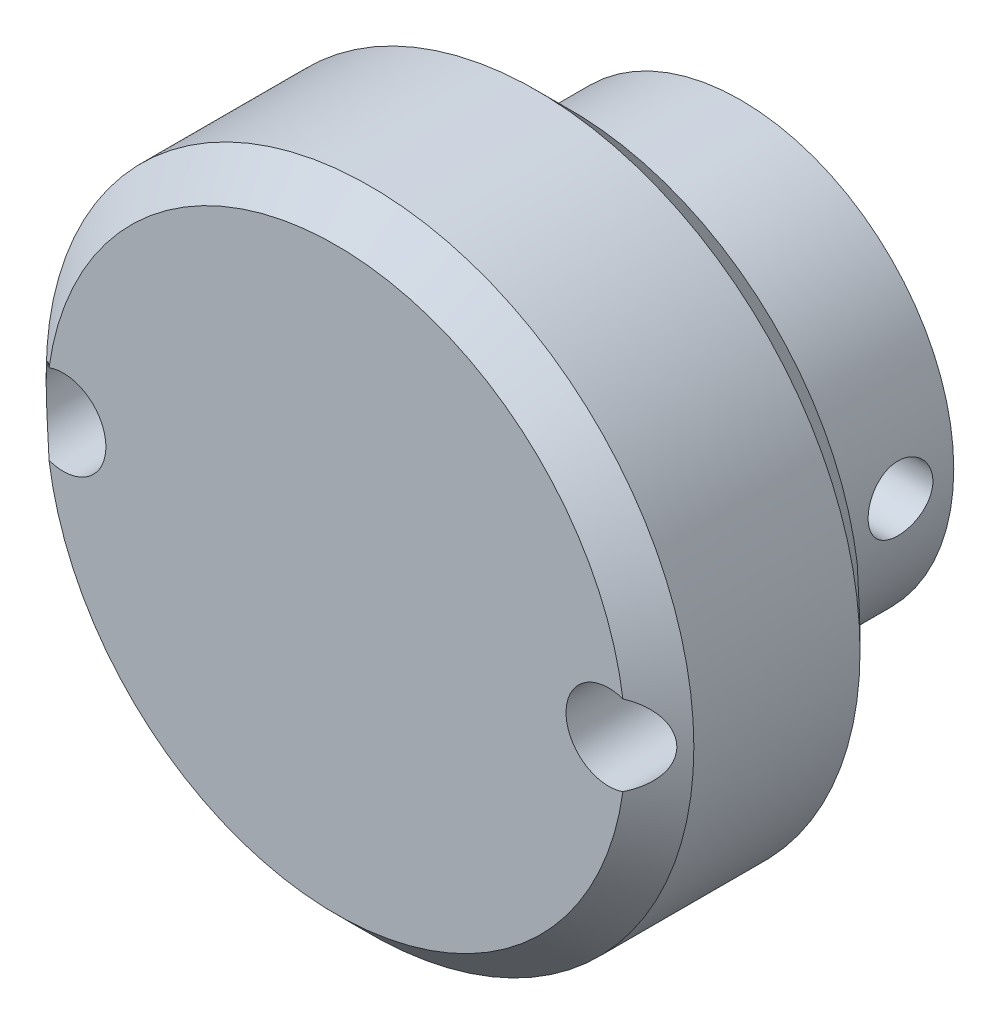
ISO-10303-21;
HEADER;
FILE_DESCRIPTION(('STEP AP214'),'2;1');
FILE_NAME('part.step','',(''),(''),'','','');
FILE_SCHEMA(('AUTOMOTIVE_DESIGN { 1 0 10303 214 1 1 1 1 }'));
ENDSEC;
DATA;
#1=APPLICATION_CONTEXT('core data for automotive mechanical design processes');
#2=APPLICATION_PROTOCOL_DEFINITION('international standard','automotive_design',2000,#1);
#3=PRODUCT_CONTEXT('',#1,'mechanical');
#4=PRODUCT('Part','Part','',(#3));
#5=PRODUCT_RELATED_PRODUCT_CATEGORY('part','',(#4));
#6=PRODUCT_DEFINITION_FORMATION('','',#4);
#7=PRODUCT_DEFINITION_CONTEXT('part definition',#1,'design');
#8=PRODUCT_DEFINITION('design','',#6,#7);
#9=PRODUCT_DEFINITION_SHAPE('','',#8);
#10=(LENGTH_UNIT() NAMED_UNIT(*) SI_UNIT(.MILLI.,.METRE.));
#11=(NAMED_UNIT(*) PLANE_ANGLE_UNIT() SI_UNIT($,.RADIAN.));
#12=(NAMED_UNIT(*) SI_UNIT($,.STERADIAN.) SOLID_ANGLE_UNIT());
#13=UNCERTAINTY_MEASURE_WITH_UNIT(LENGTH_MEASURE(1.E-05),#10,'distance_accuracy_value','');
#14=(GEOMETRIC_REPRESENTATION_CONTEXT(3) GLOBAL_UNCERTAINTY_ASSIGNED_CONTEXT((#13)) GLOBAL_UNIT_ASSIGNED_CONTEXT((#10,
#11,#12)) REPRESENTATION_CONTEXT('',''));
#15=CARTESIAN_POINT('',(0.,0.,0.));
#16=DIRECTION('',(0.,0.,1.));
#17=DIRECTION('',(1.,0.,0.));
#18=AXIS2_PLACEMENT_3D('',#15,#16,#17);
#19=CARTESIAN_POINT('',(0.,15.875,15.875));
#20=DIRECTION('',(0.,0.,-1.));
#21=DIRECTION('',(0.,1.,0.));
#22=AXIS2_PLACEMENT_3D('',#19,#20,#21);
#23=PLANE('',#22);
#24=CARTESIAN_POINT('',(0.,0.,15.875));
#25=DIRECTION('',(0.,0.,-1.));
#26=DIRECTION('',(0.,1.,0.));
#27=AXIS2_PLACEMENT_3D('',#24,#25,#26);
#28=CIRCLE('',#27,15.875);
#29=CARTESIAN_POINT('',(0.,15.875,15.875));
#30=VERTEX_POINT('',#29);
#31=EDGE_CURVE('E103',#30,#30,#28,.T.);
#32=ORIENTED_EDGE('',*,*,#31,.F.);
#33=EDGE_LOOP('',(#32));
#34=FACE_BOUND('',#33,.T.);
#35=CARTESIAN_POINT('',(-20.32,0.,15.875));
#36=DIRECTION('',(0.,0.,-1.));
#37=DIRECTION('',(0.,1.,0.));
#38=AXIS2_PLACEMENT_3D('',#35,#36,#37);
#39=CIRCLE('',#38,3.175);
#40=CARTESIAN_POINT('',(-21.381640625,2.9922473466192,15.875));
#41=VERTEX_POINT('',#40);
#42=CARTESIAN_POINT('',(-21.381640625,-2.9922473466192,15.875));
#43=VERTEX_POINT('',#42);
#44=EDGE_CURVE('E305',#41,#43,#39,.T.);
#45=ORIENTED_EDGE('',*,*,#44,.F.);
#46=CARTESIAN_POINT('',(0.,0.,15.875));
#47=DIRECTION('',(0.,0.,-1.));
#48=DIRECTION('',(0.,1.,0.));
#49=AXIS2_PLACEMENT_3D('',#46,#47,#48);
#50=CIRCLE('',#49,21.59);
#51=CARTESIAN_POINT('',(21.381640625,2.9922473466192,15.875));
#52=VERTEX_POINT('',#51);
#53=EDGE_CURVE('E143',#41,#52,#50,.T.);
#54=ORIENTED_EDGE('',*,*,#53,.T.);
#55=CARTESIAN_POINT('',(20.32,0.,15.875));
#56=DIRECTION('',(0.,0.,-1.));
#57=DIRECTION('',(0.,1.,0.));
#58=AXIS2_PLACEMENT_3D('',#55,#56,#57);
#59=CIRCLE('',#58,3.175);
#60=CARTESIAN_POINT('',(21.381640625,-2.9922473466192,15.875));
#61=VERTEX_POINT('',#60);
#62=EDGE_CURVE('E99',#61,#52,#59,.T.);
#63=ORIENTED_EDGE('',*,*,#62,.F.);
#64=CARTESIAN_POINT('',(0.,0.,15.875));
#65=DIRECTION('',(0.,0.,-1.));
#66=DIRECTION('',(0.,1.,0.));
#67=AXIS2_PLACEMENT_3D('',#64,#65,#66);
#68=CIRCLE('',#67,21.59);
#69=EDGE_CURVE('E61',#61,#43,#68,.T.);
#70=ORIENTED_EDGE('',*,*,#69,.T.);
#71=EDGE_LOOP('',(#45,#54,#63,#70));
#72=FACE_BOUND('',#71,.T.);
#73=ADVANCED_FACE('F40',(#34,#72),#23,.T.);
#74=CARTESIAN_POINT('',(0.,28.575,33.3375));
#75=DIRECTION('',(0.,0.,1.));
#76=DIRECTION('',(0.,-1.,0.));
#77=AXIS2_PLACEMENT_3D('',#74,#75,#76);
#78=PLANE('',#77);
#79=CARTESIAN_POINT('',(-20.32,0.,33.3375));
#80=DIRECTION('',(0.,0.,-1.));
#81=DIRECTION('',(0.,1.,0.));
#82=AXIS2_PLACEMENT_3D('',#79,#80,#81);
#83=CIRCLE('',#82,3.175);
#84=CARTESIAN_POINT('',(-21.381640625,2.9922473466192,33.3375));
#85=VERTEX_POINT('',#84);
#86=CARTESIAN_POINT('',(-21.381640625,-2.99224734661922,33.3375));
#87=VERTEX_POINT('',#86);
#88=EDGE_CURVE('E304',#85,#87,#83,.T.);
#89=ORIENTED_EDGE('',*,*,#88,.T.);
#90=CARTESIAN_POINT('',(0.,0.,33.3375));
#91=DIRECTION('',(0.,0.,1.));
#92=DIRECTION('',(0.,-1.,0.));
#93=AXIS2_PLACEMENT_3D('',#90,#91,#92);
#94=CIRCLE('',#93,21.59);
#95=CARTESIAN_POINT('',(21.381640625,-2.99224734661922,33.3375));
#96=VERTEX_POINT('',#95);
#97=EDGE_CURVE('E91',#87,#96,#94,.T.);
#98=ORIENTED_EDGE('',*,*,#97,.T.);
#99=CARTESIAN_POINT('',(20.32,0.,33.3375));
#100=DIRECTION('',(0.,0.,-1.));
#101=DIRECTION('',(0.,1.,0.));
#102=AXIS2_PLACEMENT_3D('',#99,#100,#101);
#103=CIRCLE('',#102,3.175);
#104=CARTESIAN_POINT('',(21.381640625,2.9922473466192,33.3375));
#105=VERTEX_POINT('',#104);
#106=EDGE_CURVE('E85',#96,#105,#103,.T.);
#107=ORIENTED_EDGE('',*,*,#106,.T.);
#108=CARTESIAN_POINT('',(0.,0.,33.3375));
#109=DIRECTION('',(0.,0.,1.));
#110=DIRECTION('',(0.,-1.,0.));
#111=AXIS2_PLACEMENT_3D('',#108,#109,#110);
#112=CIRCLE('',#111,21.59);
#113=EDGE_CURVE('E96',#105,#85,#112,.T.);
#114=ORIENTED_EDGE('',*,*,#113,.T.);
#115=EDGE_LOOP('',(#89,#98,#107,#114));
#116=FACE_BOUND('',#115,.T.);
#117=ADVANCED_FACE('F95',(#116),#78,.T.);
#118=CARTESIAN_POINT('',(0.,0.,0.));
#119=DIRECTION('',(0.,0.,-1.));
#120=DIRECTION('',(0.,1.,0.));
#121=AXIS2_PLACEMENT_3D('',#118,#119,#120);
#122=CYLINDRICAL_SURFACE('',#121,15.875);
#123=CARTESIAN_POINT('',(0.,0.,3.175));
#124=DIRECTION('',(0.,0.,-1.));
#125=DIRECTION('',(0.,1.,0.));
#126=AXIS2_PLACEMENT_3D('',#123,#124,#125);
#127=CIRCLE('',#126,15.875);
#128=CARTESIAN_POINT('',(0.,15.875,3.175));
#129=VERTEX_POINT('',#128);
#130=EDGE_CURVE('E193',#129,#129,#127,.F.);
#131=ORIENTED_EDGE('',*,*,#130,.T.);
#132=EDGE_LOOP('',(#131));
#133=FACE_BOUND('',#132,.T.);
#134=ORIENTED_EDGE('',*,*,#31,.T.);
#135=EDGE_LOOP('',(#134));
#136=FACE_BOUND('',#135,.T.);
#137=CARTESIAN_POINT('',(15.875,0.,9.55675));
#138=CARTESIAN_POINT('',(15.8749978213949,0.134706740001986,9.55674446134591));
#139=CARTESIAN_POINT('',(15.8732674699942,0.26949111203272,9.54543182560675));
#140=CARTESIAN_POINT('',(15.8665312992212,0.535290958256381,9.50049247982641));
#141=CARTESIAN_POINT('',(15.8615223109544,0.666302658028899,9.46684418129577));
#142=CARTESIAN_POINT('',(15.8487916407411,0.920672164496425,9.37826340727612));
#143=CARTESIAN_POINT('',(15.8410720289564,1.0440357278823,9.32334717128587));
#144=CARTESIAN_POINT('',(15.823772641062,1.27977838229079,9.19382940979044));
#145=CARTESIAN_POINT('',(15.814193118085,1.39215896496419,9.11923056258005));
#146=CARTESIAN_POINT('',(15.794152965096,1.60366458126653,8.95182836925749));
#147=CARTESIAN_POINT('',(15.7836865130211,1.70268885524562,8.85889840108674));
#148=CARTESIAN_POINT('',(15.7630975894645,1.88380146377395,8.65774439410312));
#149=CARTESIAN_POINT('',(15.7529751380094,1.96588881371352,8.54951946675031));
#150=CARTESIAN_POINT('',(15.7341638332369,2.11119099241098,8.32016888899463));
#151=CARTESIAN_POINT('',(15.7254825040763,2.17430808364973,8.19898064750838));
#152=CARTESIAN_POINT('',(15.7106160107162,2.27925343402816,7.94756905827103));
#153=CARTESIAN_POINT('',(15.7044307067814,2.32108288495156,7.81734621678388));
#154=CARTESIAN_POINT('',(15.6953139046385,2.38195211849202,7.55262265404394));
#155=CARTESIAN_POINT('',(15.6923577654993,2.40116457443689,7.41816250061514));
#156=CARTESIAN_POINT('',(15.6899592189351,2.41678942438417,7.14789676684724));
#157=CARTESIAN_POINT('',(15.6905166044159,2.41320316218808,7.01209126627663));
#158=CARTESIAN_POINT('',(15.6950596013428,2.38347343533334,6.74421111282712));
#159=CARTESIAN_POINT('',(15.6990159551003,2.35752247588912,6.61211452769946));
#160=CARTESIAN_POINT('',(15.7098653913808,2.2841014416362,6.35417261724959));
#161=CARTESIAN_POINT('',(15.7167585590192,2.23663074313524,6.22832747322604));
#162=CARTESIAN_POINT('',(15.7327371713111,2.12131811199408,5.9858760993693));
#163=CARTESIAN_POINT('',(15.7418313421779,2.05339482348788,5.86930916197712));
#164=CARTESIAN_POINT('',(15.7611809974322,1.89916302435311,5.64915446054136));
#165=CARTESIAN_POINT('',(15.7714365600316,1.81285327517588,5.54556757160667));
#166=CARTESIAN_POINT('',(15.7920826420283,1.62324277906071,5.35319788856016));
#167=CARTESIAN_POINT('',(15.8024734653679,1.51977656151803,5.26457814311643));
#168=CARTESIAN_POINT('',(15.8221214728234,1.29935362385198,5.10593564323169));
#169=CARTESIAN_POINT('',(15.831378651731,1.18239684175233,5.03591297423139));
#170=CARTESIAN_POINT('',(15.8477263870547,0.938170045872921,4.91644318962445));
#171=CARTESIAN_POINT('',(15.8548155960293,0.810893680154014,4.86700886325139));
#172=CARTESIAN_POINT('',(15.8660174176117,0.549713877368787,4.79026186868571));
#173=CARTESIAN_POINT('',(15.8701302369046,0.415810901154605,4.76294766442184));
#174=CARTESIAN_POINT('',(15.8748884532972,0.146585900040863,4.73143355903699));
#175=CARTESIAN_POINT('',(15.8755674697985,0.0112906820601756,4.72700953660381));
#176=CARTESIAN_POINT('',(15.8734731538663,-0.258109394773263,4.74080618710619));
#177=CARTESIAN_POINT('',(15.8706999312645,-0.392214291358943,4.75902613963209));
#178=CARTESIAN_POINT('',(15.8620335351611,-0.654746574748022,4.81740716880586));
#179=CARTESIAN_POINT('',(15.8561559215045,-0.783198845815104,4.85745885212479));
#180=CARTESIAN_POINT('',(15.8419375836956,-1.03156508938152,4.95825091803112));
#181=CARTESIAN_POINT('',(15.8335967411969,-1.1514786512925,5.01899229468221));
#182=CARTESIAN_POINT('',(15.8152951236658,-1.38034770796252,5.15996388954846));
#183=CARTESIAN_POINT('',(15.8053227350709,-1.48921484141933,5.24033602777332));
#184=CARTESIAN_POINT('',(15.7849035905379,-1.69199573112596,5.41809035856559));
#185=CARTESIAN_POINT('',(15.7744568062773,-1.78590859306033,5.5154735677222));
#186=CARTESIAN_POINT('',(15.75415944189,-1.956932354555,5.7254843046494));
#187=CARTESIAN_POINT('',(15.7443147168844,-2.0338928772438,5.83823494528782));
#188=CARTESIAN_POINT('',(15.7264404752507,-2.16778150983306,6.0751950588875));
#189=CARTESIAN_POINT('',(15.7184109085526,-2.22471017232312,6.19940421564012));
#190=CARTESIAN_POINT('',(15.7051186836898,-2.31668695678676,6.45531032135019));
#191=CARTESIAN_POINT('',(15.6998460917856,-2.35181372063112,6.58697846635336));
#192=CARTESIAN_POINT('',(15.6926385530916,-2.39943957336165,6.85443162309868));
#193=CARTESIAN_POINT('',(15.6907033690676,-2.41194027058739,6.99021634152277));
#194=CARTESIAN_POINT('',(15.6903987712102,-2.41392011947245,7.26054905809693));
#195=CARTESIAN_POINT('',(15.6919927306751,-2.40363574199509,7.39509534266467));
#196=CARTESIAN_POINT('',(15.6984871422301,-2.36084464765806,7.66052093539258));
#197=CARTESIAN_POINT('',(15.7033875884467,-2.32833797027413,7.79140025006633));
#198=CARTESIAN_POINT('',(15.7159298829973,-2.24210945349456,8.04570820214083));
#199=CARTESIAN_POINT('',(15.7235695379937,-2.18840458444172,8.16914270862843));
#200=CARTESIAN_POINT('',(15.7407320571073,-2.06132777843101,8.40528773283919));
#201=CARTESIAN_POINT('',(15.7502549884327,-1.98795513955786,8.51799786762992));
#202=CARTESIAN_POINT('',(15.7702286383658,-1.82276818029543,8.73069539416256));
#203=CARTESIAN_POINT('',(15.7806875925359,-1.73077885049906,8.83054611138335));
#204=CARTESIAN_POINT('',(15.8012864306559,-1.53133960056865,9.01347736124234));
#205=CARTESIAN_POINT('',(15.8114262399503,-1.42388609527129,9.09655399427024));
#206=CARTESIAN_POINT('',(15.8303099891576,-1.19585219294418,9.24400015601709));
#207=CARTESIAN_POINT('',(15.8390457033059,-1.07520093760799,9.30826113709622));
#208=CARTESIAN_POINT('',(15.8540564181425,-0.824740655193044,9.41550959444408));
#209=CARTESIAN_POINT('',(15.8603339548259,-0.694941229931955,9.45851900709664));
#210=CARTESIAN_POINT('',(15.8682952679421,-0.470473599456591,9.51233448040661));
#211=CARTESIAN_POINT('',(15.8707965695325,-0.377187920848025,9.52896470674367));
#212=CARTESIAN_POINT('',(15.8741496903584,-0.189280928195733,9.55117434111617));
#213=CARTESIAN_POINT('',(15.8750015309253,-0.0946596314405,9.55675389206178));
#214=CARTESIAN_POINT('',(15.875,0.,9.55675));
#215=B_SPLINE_CURVE_WITH_KNOTS('',3,(#137,#138,#139,#140,#141,#142,#143,#144,#145,#146,#147,
#148,#149,#150,#151,#152,#153,#154,#155,#156,#157,#158,#159,#160,#161,#162,#163,#164,#165,#166,
#167,#168,#169,#170,#171,#172,#173,#174,#175,#176,#177,#178,#179,#180,#181,#182,#183,#184,#185,
#186,#187,#188,#189,#190,#191,#192,#193,#194,#195,#196,#197,#198,#199,#200,#201,#202,#203,#204,
#205,#206,#207,#208,#209,#210,#211,#212,#213,#214),.UNSPECIFIED.,.T.,.F.,(4,2,2,2,2,2,2,2,2,2,2,
2,2,2,2,2,2,2,2,2,2,2,2,2,2,2,2,2,2,2,2,2,2,2,2,2,2,2,4),(0.,0.403774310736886,
0.807939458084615,1.21179660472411,1.615598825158,2.02229467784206,2.42901416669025,
2.83779456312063,3.24655207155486,3.65216818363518,4.05776038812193,4.45989591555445,
4.86204309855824,5.26581155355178,5.66960721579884,6.07755188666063,6.48549843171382,
6.89369801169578,7.30186924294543,7.70603633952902,8.11019057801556,8.51233807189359,
8.91450489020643,9.31967000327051,9.72485933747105,10.1335098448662,10.5421490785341,
10.9493056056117,11.3564331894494,11.7593552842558,12.1622766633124,12.5648761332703,
12.9674899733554,13.3740808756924,13.7807661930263,14.189753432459,14.5983176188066,
14.8820571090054,15.1657929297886),.UNSPECIFIED.);
#216=CARTESIAN_POINT('',(15.875,0.,9.55675));
#217=VERTEX_POINT('',#216);
#218=EDGE_CURVE('E200',#217,#217,#215,.T.);
#219=ORIENTED_EDGE('',*,*,#218,.T.);
#220=EDGE_LOOP('',(#219));
#221=FACE_BOUND('',#220,.T.);
#222=CARTESIAN_POINT('',(-2.41300000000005,-15.6905403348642,7.14375));
#223=CARTESIAN_POINT('',(-2.41299445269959,-15.6905426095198,7.27844660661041));
#224=CARTESIAN_POINT('',(-2.40168346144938,-15.6922935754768,7.4132208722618));
#225=CARTESIAN_POINT('',(-2.35675124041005,-15.6991033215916,7.6789997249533));
#226=CARTESIAN_POINT('',(-2.32310838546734,-15.7041653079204,7.81000052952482));
#227=CARTESIAN_POINT('',(-2.23454353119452,-15.7170108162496,8.06434698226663));
#228=CARTESIAN_POINT('',(-2.17963802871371,-15.7247922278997,8.18769847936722));
#229=CARTESIAN_POINT('',(-2.05014555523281,-15.7421973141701,8.42342085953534));
#230=CARTESIAN_POINT('',(-1.97556123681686,-15.7518207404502,8.53579321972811));
#231=CARTESIAN_POINT('',(-1.80817381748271,-15.7719139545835,8.7473078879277));
#232=CARTESIAN_POINT('',(-1.71524084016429,-15.782389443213,8.84634688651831));
#233=CARTESIAN_POINT('',(-1.51407460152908,-15.8029556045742,9.02748798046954));
#234=CARTESIAN_POINT('',(-1.40584049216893,-15.8130462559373,9.10958913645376));
#235=CARTESIAN_POINT('',(-1.17648163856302,-15.8317655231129,9.2549059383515));
#236=CARTESIAN_POINT('',(-1.05529588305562,-15.8403866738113,9.3180263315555));
#237=CARTESIAN_POINT('',(-0.803889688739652,-15.8551323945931,9.42297846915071));
#238=CARTESIAN_POINT('',(-0.673669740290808,-15.8612571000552,9.4648113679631));
#239=CARTESIAN_POINT('',(-0.408955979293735,-15.8702796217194,9.52568753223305));
#240=CARTESIAN_POINT('',(-0.274502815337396,-15.8732019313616,9.54490386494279));
#241=CARTESIAN_POINT('',(-0.00425083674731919,-15.8755743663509,9.56053889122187));
#242=CARTESIAN_POINT('',(0.131547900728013,-15.8750246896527,9.55695888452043));
#243=CARTESIAN_POINT('',(0.399455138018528,-15.8705346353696,9.52723924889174));
#244=CARTESIAN_POINT('',(0.531584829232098,-15.8666222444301,9.50128582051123));
#245=CARTESIAN_POINT('',(0.789591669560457,-15.8558775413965,9.42784844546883));
#246=CARTESIAN_POINT('',(0.915468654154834,-15.8490451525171,9.38036393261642));
#247=CARTESIAN_POINT('',(1.15795934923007,-15.8331800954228,9.26502232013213));
#248=CARTESIAN_POINT('',(1.27453529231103,-15.8241390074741,9.19708702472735));
#249=CARTESIAN_POINT('',(1.49470295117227,-15.8048638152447,9.04282939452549));
#250=CARTESIAN_POINT('',(1.59829378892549,-15.7946296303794,8.95650581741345));
#251=CARTESIAN_POINT('',(1.79064855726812,-15.7739872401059,8.76688527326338));
#252=CARTESIAN_POINT('',(1.8792522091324,-15.7635783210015,8.66342571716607));
#253=CARTESIAN_POINT('',(2.03786537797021,-15.7438603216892,8.44302192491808));
#254=CARTESIAN_POINT('',(2.10787477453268,-15.7345512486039,8.32607760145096));
#255=CARTESIAN_POINT('',(2.22733490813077,-15.7180870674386,8.08185466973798));
#256=CARTESIAN_POINT('',(2.27676884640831,-15.7109337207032,7.95456771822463));
#257=CARTESIAN_POINT('',(2.35351184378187,-15.6996218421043,7.69336483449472));
#258=CARTESIAN_POINT('',(2.38082250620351,-15.6954630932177,7.55944938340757));
#259=CARTESIAN_POINT('',(2.41232321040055,-15.690652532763,7.29021781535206));
#260=CARTESIAN_POINT('',(2.41674060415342,-15.6899662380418,7.15492889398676));
#261=CARTESIAN_POINT('',(2.40293294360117,-15.6920867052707,6.88554298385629));
#262=CARTESIAN_POINT('',(2.38470861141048,-15.69489335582,6.75144595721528));
#263=CARTESIAN_POINT('',(2.32632776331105,-15.7036517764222,6.48895675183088));
#264=CARTESIAN_POINT('',(2.28628479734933,-15.7095872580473,6.36053872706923));
#265=CARTESIAN_POINT('',(2.18552158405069,-15.7239211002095,6.11223713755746));
#266=CARTESIAN_POINT('',(2.12480029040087,-15.7323195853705,5.99235400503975));
#267=CARTESIAN_POINT('',(1.98385894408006,-15.7507142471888,5.7635069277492));
#268=CARTESIAN_POINT('',(1.90349188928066,-15.760722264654,5.65463448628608));
#269=CARTESIAN_POINT('',(1.72574440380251,-15.7811727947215,5.45184053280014));
#270=CARTESIAN_POINT('',(1.6283629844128,-15.7916153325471,5.35791989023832));
#271=CARTESIAN_POINT('',(1.41834912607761,-15.8118662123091,5.18687752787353));
#272=CARTESIAN_POINT('',(1.30559320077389,-15.8216683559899,5.10990658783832));
#273=CARTESIAN_POINT('',(1.06861956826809,-15.8394373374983,4.97599969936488));
#274=CARTESIAN_POINT('',(0.94440218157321,-15.8474042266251,4.91906319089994));
#275=CARTESIAN_POINT('',(0.688499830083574,-15.8605779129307,4.82708158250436));
#276=CARTESIAN_POINT('',(0.556844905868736,-15.8657950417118,4.79195444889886));
#277=CARTESIAN_POINT('',(0.289419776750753,-15.8729247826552,4.74432338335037));
#278=CARTESIAN_POINT('',(0.15364985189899,-15.8748376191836,4.73181791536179));
#279=CARTESIAN_POINT('',(-0.116689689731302,-15.8751408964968,4.72982342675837));
#280=CARTESIAN_POINT('',(-0.251257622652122,-15.8735666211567,4.74010385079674));
#281=CARTESIAN_POINT('',(-0.516727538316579,-15.86714381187,4.78289462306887));
#282=CARTESIAN_POINT('',(-0.647629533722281,-15.8622952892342,4.81540489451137));
#283=CARTESIAN_POINT('',(-0.901985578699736,-15.8498663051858,4.90164993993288));
#284=CARTESIAN_POINT('',(-1.02544529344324,-15.8422879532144,4.95536832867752));
#285=CARTESIAN_POINT('',(-1.26163514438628,-15.8252311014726,5.08248003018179));
#286=CARTESIAN_POINT('',(-1.37436491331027,-15.8157525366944,5.15587401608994));
#287=CARTESIAN_POINT('',(-1.58706338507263,-15.7958346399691,5.32108532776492));
#288=CARTESIAN_POINT('',(-1.68689921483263,-15.7853869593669,5.41307272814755));
#289=CARTESIAN_POINT('',(-1.86980132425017,-15.7647696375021,5.61250187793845));
#290=CARTESIAN_POINT('',(-1.95286366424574,-15.754600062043,5.71994724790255));
#291=CARTESIAN_POINT('',(-2.10029339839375,-15.735627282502,5.9479736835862));
#292=CARTESIAN_POINT('',(-2.16454993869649,-15.726832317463,6.06862709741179));
#293=CARTESIAN_POINT('',(-2.27178950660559,-15.7117012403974,6.3190917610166));
#294=CARTESIAN_POINT('',(-2.31479451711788,-15.7053625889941,6.44889338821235));
#295=CARTESIAN_POINT('',(-2.36859835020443,-15.6973195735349,6.6733494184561));
#296=CARTESIAN_POINT('',(-2.38522335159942,-15.6947909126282,6.76662049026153));
#297=CARTESIAN_POINT('',(-2.40742605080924,-15.6914005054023,6.95449827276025));
#298=CARTESIAN_POINT('',(-2.41300389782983,-15.6905387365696,7.04910496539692));
#299=CARTESIAN_POINT('',(-2.41300000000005,-15.6905403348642,7.14375));
#300=B_SPLINE_CURVE_WITH_KNOTS('',3,(#222,#223,#224,#225,#226,#227,#228,#229,#230,#231,#232,
#233,#234,#235,#236,#237,#238,#239,#240,#241,#242,#243,#244,#245,#246,#247,#248,#249,#250,#251,
#252,#253,#254,#255,#256,#257,#258,#259,#260,#261,#262,#263,#264,#265,#266,#267,#268,#269,#270,
#271,#272,#273,#274,#275,#276,#277,#278,#279,#280,#281,#282,#283,#284,#285,#286,#287,#288,#289,
#290,#291,#292,#293,#294,#295,#296,#297,#298,#299),.UNSPECIFIED.,.T.,.F.,(4,2,2,2,2,2,2,2,2,2,2,
2,2,2,2,2,2,2,2,2,2,2,2,2,2,2,2,2,2,2,2,2,2,2,2,2,2,2,4),(0.,0.403743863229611,
0.807879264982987,1.2117017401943,1.61546981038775,2.0222055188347,2.42896377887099,
2.83773048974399,3.24647503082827,3.65207099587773,4.05764383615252,4.45987356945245,
4.86211388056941,5.26591216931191,5.66973774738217,6.07764100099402,6.48554689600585,
6.89378517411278,7.30199386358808,7.70614077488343,8.11027479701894,8.51232541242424,
8.91439637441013,9.31957328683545,9.72477375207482,10.1334449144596,10.5421046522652,
10.9492177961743,11.3563032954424,11.7592885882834,12.1622724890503,12.5649456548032,
12.9676325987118,13.3741847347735,13.780832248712,14.1898306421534,14.5984050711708,
14.8821009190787,15.1657929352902),.UNSPECIFIED.);
#301=CARTESIAN_POINT('',(-2.41300000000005,-15.6905403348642,7.14375));
#302=VERTEX_POINT('',#301);
#303=EDGE_CURVE('E190',#302,#302,#300,.T.);
#304=ORIENTED_EDGE('',*,*,#303,.T.);
#305=EDGE_LOOP('',(#304));
#306=FACE_BOUND('',#305,.T.);
#307=ADVANCED_FACE('F42',(#133,#136,#221,#306),#122,.T.);
#308=CARTESIAN_POINT('',(0.,0.,0.));
#309=DIRECTION('',(0.,0.,-1.));
#310=DIRECTION('',(0.,1.,0.));
#311=AXIS2_PLACEMENT_3D('',#308,#309,#310);
#312=CYLINDRICAL_SURFACE('',#311,4.7625);
#313=CARTESIAN_POINT('',(4.7625,0.,9.55675));
#314=CARTESIAN_POINT('',(4.76249188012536,0.126649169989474,9.55674049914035));
#315=CARTESIAN_POINT('',(4.75739362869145,0.253448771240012,9.54671960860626));
#316=CARTESIAN_POINT('',(4.7374986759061,0.503284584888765,9.5070819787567));
#317=CARTESIAN_POINT('',(4.72268421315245,0.626313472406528,9.47742935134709));
#318=CARTESIAN_POINT('',(4.68490559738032,0.864618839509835,9.39999407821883));
#319=CARTESIAN_POINT('',(4.66197341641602,0.979923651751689,9.3522825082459));
#320=CARTESIAN_POINT('',(4.61005152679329,1.20071351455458,9.24045819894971));
#321=CARTESIAN_POINT('',(4.58106219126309,1.30619916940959,9.17634646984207));
#322=CARTESIAN_POINT('',(4.51757958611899,1.51166955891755,9.02905464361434));
#323=CARTESIAN_POINT('',(4.48285720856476,1.61091451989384,8.94494282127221));
#324=CARTESIAN_POINT('',(4.41255032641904,1.79457367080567,8.7620492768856));
#325=CARTESIAN_POINT('',(4.37696517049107,1.87897623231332,8.66325616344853));
#326=CARTESIAN_POINT('',(4.30566577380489,2.0373472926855,8.4443135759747));
#327=CARTESIAN_POINT('',(4.27016993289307,2.1099366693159,8.32308689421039));
#328=CARTESIAN_POINT('',(4.20692439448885,2.23339117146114,8.06816673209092));
#329=CARTESIAN_POINT('',(4.17916906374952,2.28427210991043,7.93448241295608));
#330=CARTESIAN_POINT('',(4.13713770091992,2.35950552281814,7.66666995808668));
#331=CARTESIAN_POINT('',(4.12214753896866,2.38527718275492,7.5330583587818));
#332=CARTESIAN_POINT('',(4.10546522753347,2.41389077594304,7.26263746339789));
#333=CARTESIAN_POINT('',(4.10375928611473,2.41675649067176,7.12583163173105));
#334=CARTESIAN_POINT('',(4.11326680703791,2.40051659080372,6.87110199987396));
#335=CARTESIAN_POINT('',(4.12290928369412,2.38408320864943,6.75293460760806));
#336=CARTESIAN_POINT('',(4.15126596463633,2.33435392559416,6.52133934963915));
#337=CARTESIAN_POINT('',(4.16998319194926,2.30105240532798,6.40791307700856));
#338=CARTESIAN_POINT('',(4.21478445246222,2.2179405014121,6.18577845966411));
#339=CARTESIAN_POINT('',(4.24102946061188,2.16776471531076,6.07724083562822));
#340=CARTESIAN_POINT('',(4.29794256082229,2.05261226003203,5.86959810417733));
#341=CARTESIAN_POINT('',(4.32861263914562,1.98762893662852,5.77049726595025));
#342=CARTESIAN_POINT('',(4.39576034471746,1.83481041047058,5.57090869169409));
#343=CARTESIAN_POINT('',(4.43247317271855,1.74509874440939,5.47193174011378));
#344=CARTESIAN_POINT('',(4.50433131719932,1.55022377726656,5.28978813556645));
#345=CARTESIAN_POINT('',(4.53947583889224,1.4450527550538,5.20662943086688));
#346=CARTESIAN_POINT('',(4.6063311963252,1.21574956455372,5.05465045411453));
#347=CARTESIAN_POINT('',(4.63779030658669,1.09094195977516,4.98672946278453));
#348=CARTESIAN_POINT('',(4.69156395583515,0.829676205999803,4.87341219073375));
#349=CARTESIAN_POINT('',(4.71388593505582,0.693227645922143,4.82799757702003));
#350=CARTESIAN_POINT('',(4.74526824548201,0.42488086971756,4.76479735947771));
#351=CARTESIAN_POINT('',(4.75528777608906,0.293568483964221,4.74500563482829));
#352=CARTESIAN_POINT('',(4.76424448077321,0.0291243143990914,4.72729495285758));
#353=CARTESIAN_POINT('',(4.76318711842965,-0.104006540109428,4.72936521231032));
#354=CARTESIAN_POINT('',(4.75065721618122,-0.356966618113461,4.75418971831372));
#355=CARTESIAN_POINT('',(4.74002523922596,-0.477007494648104,4.77527484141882));
#356=CARTESIAN_POINT('',(4.71052219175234,-0.711595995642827,4.83488641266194));
#357=CARTESIAN_POINT('',(4.69165022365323,-0.826143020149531,4.87341476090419));
#358=CARTESIAN_POINT('',(4.64670633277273,-1.0502184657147,4.96778843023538));
#359=CARTESIAN_POINT('',(4.6204476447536,-1.15951663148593,5.02408832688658));
#360=CARTESIAN_POINT('',(4.5632321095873,-1.36746797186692,5.15188825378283));
#361=CARTESIAN_POINT('',(4.53227328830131,-1.46611664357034,5.22339467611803));
#362=CARTESIAN_POINT('',(4.46496330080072,-1.66045566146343,5.3878342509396));
#363=CARTESIAN_POINT('',(4.42838263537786,-1.75485954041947,5.48219631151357));
#364=CARTESIAN_POINT('',(4.35619895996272,-1.9270898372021,5.68544394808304));
#365=CARTESIAN_POINT('',(4.32059668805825,-2.00490402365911,5.79434014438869));
#366=CARTESIAN_POINT('',(4.25256664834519,-2.14557932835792,6.03067916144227));
#367=CARTESIAN_POINT('',(4.2204001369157,-2.20745276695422,6.15879186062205));
#368=CARTESIAN_POINT('',(4.16622004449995,-2.30810110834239,6.42575501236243));
#369=CARTESIAN_POINT('',(4.14419306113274,-2.34690652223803,6.56459100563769));
#370=CARTESIAN_POINT('',(4.11559214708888,-2.39667650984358,6.83471373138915));
#371=CARTESIAN_POINT('',(4.10772935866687,-2.40997137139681,6.96543134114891));
#372=CARTESIAN_POINT('',(4.10471909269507,-2.41510017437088,7.22740821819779));
#373=CARTESIAN_POINT('',(4.10956558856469,-2.4069442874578,7.35866719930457));
#374=CARTESIAN_POINT('',(4.13004566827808,-2.37159568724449,7.60410726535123));
#375=CARTESIAN_POINT('',(4.14454958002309,-2.34639260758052,7.71868159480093));
#376=CARTESIAN_POINT('',(4.18134498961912,-2.28017249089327,7.9418338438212));
#377=CARTESIAN_POINT('',(4.20363904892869,-2.23915025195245,8.05040977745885));
#378=CARTESIAN_POINT('',(4.25532018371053,-2.13939345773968,8.26654614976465));
#379=CARTESIAN_POINT('',(4.28508228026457,-2.07965672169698,8.37355165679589));
#380=CARTESIAN_POINT('',(4.34774609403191,-1.94525312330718,8.57672448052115));
#381=CARTESIAN_POINT('',(4.38064946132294,-1.87057839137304,8.67288604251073));
#382=CARTESIAN_POINT('',(4.45084946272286,-1.69738591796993,8.86425045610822));
#383=CARTESIAN_POINT('',(4.48817732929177,-1.59704956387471,8.95780620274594));
#384=CARTESIAN_POINT('',(4.55925234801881,-1.38114473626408,9.12714488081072));
#385=CARTESIAN_POINT('',(4.59299749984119,-1.26556783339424,9.20291791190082));
#386=CARTESIAN_POINT('',(4.65364913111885,-1.02029109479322,9.33489097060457));
#387=CARTESIAN_POINT('',(4.68048308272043,-0.890460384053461,9.39088553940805));
#388=CARTESIAN_POINT('',(4.7128886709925,-0.689017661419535,9.45737032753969));
#389=CARTESIAN_POINT('',(4.72237914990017,-0.620803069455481,9.47660687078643));
#390=CARTESIAN_POINT('',(4.73848995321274,-0.482637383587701,9.50905183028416));
#391=CARTESIAN_POINT('',(4.74511199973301,-0.412687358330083,9.52226386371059));
#392=CARTESIAN_POINT('',(4.75426521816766,-0.285633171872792,9.54046618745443));
#393=CARTESIAN_POINT('',(4.75734644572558,-0.228724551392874,9.54656575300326));
#394=CARTESIAN_POINT('',(4.761465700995,-0.114554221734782,9.55470986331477));
#395=CARTESIAN_POINT('',(4.76250367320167,-0.0572925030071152,9.55675429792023));
#396=CARTESIAN_POINT('',(4.7625,0.,9.55675));
#397=B_SPLINE_CURVE_WITH_KNOTS('',3,(#313,#314,#315,#316,#317,#318,#319,#320,#321,#322,#323,
#324,#325,#326,#327,#328,#329,#330,#331,#332,#333,#334,#335,#336,#337,#338,#339,#340,#341,#342,
#343,#344,#345,#346,#347,#348,#349,#350,#351,#352,#353,#354,#355,#356,#357,#358,#359,#360,#361,
#362,#363,#364,#365,#366,#367,#368,#369,#370,#371,#372,#373,#374,#375,#376,#377,#378,#379,#380,
#381,#382,#383,#384,#385,#386,#387,#388,#389,#390,#391,#392,#393,#394,#395,#396),.UNSPECIFIED.,
.T.,.F.,(4,2,2,2,2,2,2,2,2,2,2,2,2,2,2,2,2,2,2,2,2,2,2,2,2,2,2,2,2,2,2,2,2,2,2,2,2,2,2,2,2,4),
(0.,0.37972493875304,0.760145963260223,1.13908505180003,1.51800080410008,1.92027098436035,
2.3228549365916,2.75771654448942,3.19226084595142,3.60050561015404,4.00832647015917,
4.36573385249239,4.72326037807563,5.08908918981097,5.45508272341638,5.86889911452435,
6.28292289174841,6.71717919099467,7.15108117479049,7.54841100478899,7.94554486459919,
8.31088619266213,8.67626732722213,9.05187688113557,9.42764463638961,9.84105781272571,
10.2547747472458,10.6899997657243,11.1246478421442,11.5172452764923,11.9096565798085,
12.2627433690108,12.6159463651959,12.992802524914,13.3698577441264,13.7944166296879,
14.2192113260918,14.6482972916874,14.862546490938,15.0766668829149,15.2484390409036,
15.4202158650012),.UNSPECIFIED.);
#398=CARTESIAN_POINT('',(4.7625,0.,9.55675));
#399=VERTEX_POINT('',#398);
#400=EDGE_CURVE('E206',#399,#399,#397,.T.);
#401=ORIENTED_EDGE('',*,*,#400,.F.);
#402=EDGE_LOOP('',(#401));
#403=FACE_BOUND('',#402,.T.);
#404=CARTESIAN_POINT('',(0.,0.,20.6375));
#405=DIRECTION('',(0.,0.,-1.));
#406=DIRECTION('',(0.,1.,0.));
#407=AXIS2_PLACEMENT_3D('',#404,#405,#406);
#408=CIRCLE('',#407,4.76250000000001);
#409=CARTESIAN_POINT('',(0.,4.7625,20.6375));
#410=VERTEX_POINT('',#409);
#411=EDGE_CURVE('E107',#410,#410,#408,.T.);
#412=ORIENTED_EDGE('',*,*,#411,.F.);
#413=EDGE_LOOP('',(#412));
#414=FACE_BOUND('',#413,.T.);
#415=CARTESIAN_POINT('',(0.,0.,0.));
#416=DIRECTION('',(0.,0.,-1.));
#417=DIRECTION('',(0.,1.,0.));
#418=AXIS2_PLACEMENT_3D('',#415,#416,#417);
#419=CIRCLE('',#418,4.7625);
#420=CARTESIAN_POINT('',(0.,4.7625,0.));
#421=VERTEX_POINT('',#420);
#422=EDGE_CURVE('E184',#421,#421,#419,.T.);
#423=ORIENTED_EDGE('',*,*,#422,.T.);
#424=EDGE_LOOP('',(#423));
#425=FACE_BOUND('',#424,.T.);
#426=CARTESIAN_POINT('',(-2.41300000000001,-4.10595144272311,7.14375));
#427=CARTESIAN_POINT('',(-2.41298959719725,-4.10596427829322,7.26922043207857));
#428=CARTESIAN_POINT('',(-2.40314718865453,-4.11179125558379,7.39484849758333));
#429=CARTESIAN_POINT('',(-2.36428568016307,-4.13425074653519,7.64222477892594));
#430=CARTESIAN_POINT('',(-2.33522736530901,-4.15090535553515,7.76396452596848));
#431=CARTESIAN_POINT('',(-2.25952477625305,-4.19258779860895,7.999519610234));
#432=CARTESIAN_POINT('',(-2.21297597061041,-4.21757009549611,8.11337406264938));
#433=CARTESIAN_POINT('',(-2.10390518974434,-4.27302246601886,8.33162751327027));
#434=CARTESIAN_POINT('',(-2.04138198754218,-4.30349296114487,8.43602578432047));
#435=CARTESIAN_POINT('',(-1.89592129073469,-4.36964420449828,8.64217732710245));
#436=CARTESIAN_POINT('',(-1.81170207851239,-4.40554766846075,8.74295517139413));
#437=CARTESIAN_POINT('',(-1.62790296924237,-4.47672355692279,8.92971736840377));
#438=CARTESIAN_POINT('',(-1.52831528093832,-4.5119956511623,9.01569417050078));
#439=CARTESIAN_POINT('',(-1.30813045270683,-4.58087287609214,9.1762819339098));
#440=CARTESIAN_POINT('',(-1.18655293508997,-4.61419062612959,9.24968358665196));
#441=CARTESIAN_POINT('',(-0.930770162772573,-4.67249704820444,9.37454547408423));
#442=CARTESIAN_POINT('',(-0.796573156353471,-4.69749111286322,9.42601992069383));
#443=CARTESIAN_POINT('',(-0.529703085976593,-4.73472598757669,9.50167156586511));
#444=CARTESIAN_POINT('',(-0.397629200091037,-4.74776221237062,9.52756198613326));
#445=CARTESIAN_POINT('',(-0.130419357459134,-4.762589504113,9.55696217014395));
#446=CARTESIAN_POINT('',(0.00471463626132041,-4.76438758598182,9.56048589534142));
#447=CARTESIAN_POINT('',(0.261288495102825,-4.75690453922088,9.54569213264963));
#448=CARTESIAN_POINT('',(0.382874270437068,-4.74859777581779,9.52929564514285));
#449=CARTESIAN_POINT('',(0.621292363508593,-4.72332253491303,9.47857779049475));
#450=CARTESIAN_POINT('',(0.738124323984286,-4.70635340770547,9.44425507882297));
#451=CARTESIAN_POINT('',(0.965723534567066,-4.66501417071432,9.35846157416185));
#452=CARTESIAN_POINT('',(1.07638734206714,-4.64054703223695,9.30676505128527));
#453=CARTESIAN_POINT('',(1.28773137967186,-4.58640087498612,9.18801657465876));
#454=CARTESIAN_POINT('',(1.38840805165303,-4.55672000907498,9.12095917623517));
#455=CARTESIAN_POINT('',(1.5872768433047,-4.4915404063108,8.96597628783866));
#456=CARTESIAN_POINT('',(1.6842943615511,-4.45575665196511,8.8766624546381));
#457=CARTESIAN_POINT('',(1.86261687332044,-4.38421199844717,8.68340484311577));
#458=CARTESIAN_POINT('',(1.94390921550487,-4.34845114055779,8.57944940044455));
#459=CARTESIAN_POINT('',(2.09378503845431,-4.27840686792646,8.35141528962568));
#460=CARTESIAN_POINT('',(2.1611638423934,-4.24437985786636,8.22645813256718));
#461=CARTESIAN_POINT('',(2.27344012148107,-4.18532432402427,7.9648705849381));
#462=CARTESIAN_POINT('',(2.31836154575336,-4.1602862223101,7.82825281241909));
#463=CARTESIAN_POINT('',(2.38075232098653,-4.12487880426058,7.55867371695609));
#464=CARTESIAN_POINT('',(2.40012752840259,-4.11349770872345,7.42629170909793));
#465=CARTESIAN_POINT('',(2.41663192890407,-4.10382869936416,7.15971185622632));
#466=CARTESIAN_POINT('',(2.41377783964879,-4.10553094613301,7.0255154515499));
#467=CARTESIAN_POINT('',(2.38765409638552,-4.12076164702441,6.77541634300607));
#468=CARTESIAN_POINT('',(2.36674462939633,-4.13292227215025,6.65916968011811));
#469=CARTESIAN_POINT('',(2.30864143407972,-4.16565532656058,6.43206899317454));
#470=CARTESIAN_POINT('',(2.27144224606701,-4.18623057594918,6.32121679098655));
#471=CARTESIAN_POINT('',(2.18002666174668,-4.23458016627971,6.10222042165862));
#472=CARTESIAN_POINT('',(2.12510454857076,-4.26264276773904,5.99443694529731));
#473=CARTESIAN_POINT('',(2.00041157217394,-4.32256204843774,5.78898782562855));
#474=CARTESIAN_POINT('',(1.93063306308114,-4.35442067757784,5.69132743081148));
#475=CARTESIAN_POINT('',(1.76760250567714,-4.42332346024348,5.49559674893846));
#476=CARTESIAN_POINT('',(1.6724774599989,-4.46050291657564,5.3991268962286));
#477=CARTESIAN_POINT('',(1.466838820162,-4.53228965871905,5.22299873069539));
#478=CARTESIAN_POINT('',(1.35631960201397,-4.56689599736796,5.14334658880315));
#479=CARTESIAN_POINT('',(1.11866661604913,-4.63093414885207,5.00111901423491));
#480=CARTESIAN_POINT('',(0.991142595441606,-4.66018582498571,4.93910872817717));
#481=CARTESIAN_POINT('',(0.725564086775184,-4.70883457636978,4.838048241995));
#482=CARTESIAN_POINT('',(0.587519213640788,-4.72824052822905,4.79897735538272));
#483=CARTESIAN_POINT('',(0.318716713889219,-4.75355952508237,4.74835497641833));
#484=CARTESIAN_POINT('',(0.188480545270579,-4.76056236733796,4.73457636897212));
#485=CARTESIAN_POINT('',(-0.0726155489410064,-4.76373289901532,4.72831470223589));
#486=CARTESIAN_POINT('',(-0.203475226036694,-4.75990459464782,4.73582376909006));
#487=CARTESIAN_POINT('',(-0.452608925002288,-4.74247683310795,4.77047273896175));
#488=CARTESIAN_POINT('',(-0.571129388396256,-4.72956781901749,4.79622636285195));
#489=CARTESIAN_POINT('',(-0.801961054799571,-4.69594265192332,4.86473079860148));
#490=CARTESIAN_POINT('',(-0.914271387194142,-4.6752254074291,4.90748398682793));
#491=CARTESIAN_POINT('',(-1.13480267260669,-4.62676055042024,5.0106227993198));
#492=CARTESIAN_POINT('',(-1.24265424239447,-4.59875439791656,5.0716730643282));
#493=CARTESIAN_POINT('',(-1.44701973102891,-4.53860183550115,5.2088417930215));
#494=CARTESIAN_POINT('',(-1.54352844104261,-4.50645353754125,5.28496713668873));
#495=CARTESIAN_POINT('',(-1.73283872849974,-4.43732295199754,5.45910967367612));
#496=CARTESIAN_POINT('',(-1.82426234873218,-4.40018175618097,5.55856666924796));
#497=CARTESIAN_POINT('',(-1.98965098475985,-4.32791598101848,5.77185011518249));
#498=CARTESIAN_POINT('',(-2.06359983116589,-4.29279329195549,5.8856897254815));
#499=CARTESIAN_POINT('',(-2.1942476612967,-4.22755697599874,6.13002032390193));
#500=CARTESIAN_POINT('',(-2.25023530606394,-4.1976673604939,6.26096115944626));
#501=CARTESIAN_POINT('',(-2.31646335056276,-4.16125292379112,6.46429634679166));
#502=CARTESIAN_POINT('',(-2.33557123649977,-4.15052398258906,6.53316372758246));
#503=CARTESIAN_POINT('',(-2.36765850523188,-4.13230494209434,6.67271433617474));
#504=CARTESIAN_POINT('',(-2.38064213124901,-4.12481260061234,6.74339627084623));
#505=CARTESIAN_POINT('',(-2.39794173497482,-4.11477288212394,6.86904767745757));
#506=CARTESIAN_POINT('',(-2.40358148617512,-4.11147504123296,6.92377919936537));
#507=CARTESIAN_POINT('',(-2.41111302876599,-4.10706142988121,7.03358033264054));
#508=CARTESIAN_POINT('',(-2.41300456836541,-4.10594580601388,7.08864996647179));
#509=CARTESIAN_POINT('',(-2.41300000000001,-4.10595144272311,7.14375));
#510=B_SPLINE_CURVE_WITH_KNOTS('',3,(#426,#427,#428,#429,#430,#431,#432,#433,#434,#435,#436,
#437,#438,#439,#440,#441,#442,#443,#444,#445,#446,#447,#448,#449,#450,#451,#452,#453,#454,#455,
#456,#457,#458,#459,#460,#461,#462,#463,#464,#465,#466,#467,#468,#469,#470,#471,#472,#473,#474,
#475,#476,#477,#478,#479,#480,#481,#482,#483,#484,#485,#486,#487,#488,#489,#490,#491,#492,#493,
#494,#495,#496,#497,#498,#499,#500,#501,#502,#503,#504,#505,#506,#507,#508,#509),.UNSPECIFIED.,
.T.,.F.,(4,2,2,2,2,2,2,2,2,2,2,2,2,2,2,2,2,2,2,2,2,2,2,2,2,2,2,2,2,2,2,2,2,2,2,2,2,2,2,2,2,4),
(0.,0.376188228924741,0.753146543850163,1.12807650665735,1.50303527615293,1.90979790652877,
2.31676743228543,2.75209273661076,3.18713545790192,3.59053368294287,3.99368007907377,
4.36085058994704,4.72804864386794,5.10021487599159,5.47251322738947,5.88069274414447,
6.28919929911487,6.72487227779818,7.16007964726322,7.56053080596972,7.96068083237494,
8.31529503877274,8.67002818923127,9.04112183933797,9.41240693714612,9.8320075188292,
10.2517617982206,10.6837456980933,11.1153394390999,11.5066726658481,11.8978611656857,
12.262133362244,12.6264564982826,13.0060681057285,13.3858533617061,13.8043077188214,
14.2231477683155,14.6569640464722,14.8734832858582,15.0898522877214,15.2550433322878,
15.4202454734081),.UNSPECIFIED.);
#511=CARTESIAN_POINT('',(-2.41300000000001,-4.10595144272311,7.14375));
#512=VERTEX_POINT('',#511);
#513=EDGE_CURVE('E98',#512,#512,#510,.T.);
#514=ORIENTED_EDGE('',*,*,#513,.F.);
#515=EDGE_LOOP('',(#514));
#516=FACE_BOUND('',#515,.T.);
#517=ADVANCED_FACE('F172',(#403,#414,#425,#516),#312,.F.);
#518=CARTESIAN_POINT('',(0.,0.,0.));
#519=DIRECTION('',(0.,0.,-1.));
#520=DIRECTION('',(0.,1.,0.));
#521=AXIS2_PLACEMENT_3D('',#518,#519,#520);
#522=PLANE('',#521);
#523=ORIENTED_EDGE('',*,*,#422,.F.);
#524=EDGE_LOOP('',(#523));
#525=FACE_BOUND('',#524,.T.);
#526=CARTESIAN_POINT('',(0.,0.,0.));
#527=DIRECTION('',(0.,0.,-1.));
#528=DIRECTION('',(0.,1.,0.));
#529=AXIS2_PLACEMENT_3D('',#526,#527,#528);
#530=CIRCLE('',#529,9.99998);
#531=CARTESIAN_POINT('',(0.,9.99998,0.));
#532=VERTEX_POINT('',#531);
#533=EDGE_CURVE('E187',#532,#532,#530,.T.);
#534=ORIENTED_EDGE('',*,*,#533,.T.);
#535=EDGE_LOOP('',(#534));
#536=FACE_BOUND('',#535,.T.);
#537=ADVANCED_FACE('F169',(#525,#536),#522,.T.);
#538=CARTESIAN_POINT('',(0.,4.7625,20.6375));
#539=DIRECTION('',(0.,0.,1.));
#540=DIRECTION('',(0.,-1.,0.));
#541=AXIS2_PLACEMENT_3D('',#538,#539,#540);
#542=PLANE('',#541);
#543=ORIENTED_EDGE('',*,*,#411,.T.);
#544=EDGE_LOOP('',(#543));
#545=FACE_BOUND('',#544,.T.);
#546=ADVANCED_FACE('F171',(#545),#542,.F.);
#547=CARTESIAN_POINT('',(31.75,0.,7.14375));
#548=DIRECTION('',(-1.,0.,0.));
#549=DIRECTION('',(0.,0.,1.));
#550=AXIS2_PLACEMENT_3D('',#547,#548,#549);
#551=CYLINDRICAL_SURFACE('',#550,2.413);
#552=ORIENTED_EDGE('',*,*,#218,.F.);
#553=EDGE_LOOP('',(#552));
#554=FACE_BOUND('',#553,.T.);
#555=ORIENTED_EDGE('',*,*,#400,.T.);
#556=EDGE_LOOP('',(#555));
#557=FACE_BOUND('',#556,.T.);
#558=ADVANCED_FACE('F178',(#554,#557),#551,.F.);
#559=CARTESIAN_POINT('',(0.,0.,3.175));
#560=DIRECTION('',(0.,0.,-1.));
#561=DIRECTION('',(0.,1.,0.));
#562=AXIS2_PLACEMENT_3D('',#559,#560,#561);
#563=PLANE('',#562);
#564=ORIENTED_EDGE('',*,*,#130,.F.);
#565=EDGE_LOOP('',(#564));
#566=FACE_BOUND('',#565,.T.);
#567=CARTESIAN_POINT('',(0.,0.,3.175));
#568=DIRECTION('',(0.,0.,-1.));
#569=DIRECTION('',(0.,1.,0.));
#570=AXIS2_PLACEMENT_3D('',#567,#568,#569);
#571=CIRCLE('',#570,9.99998);
#572=CARTESIAN_POINT('',(0.,9.99998,3.175));
#573=VERTEX_POINT('',#572);
#574=EDGE_CURVE('E189',#573,#573,#571,.T.);
#575=ORIENTED_EDGE('',*,*,#574,.F.);
#576=EDGE_LOOP('',(#575));
#577=FACE_BOUND('',#576,.T.);
#578=ADVANCED_FACE('F211',(#566,#577),#563,.T.);
#579=CARTESIAN_POINT('',(0.,0.,3.175));
#580=DIRECTION('',(0.,0.,-1.));
#581=DIRECTION('',(0.,1.,0.));
#582=AXIS2_PLACEMENT_3D('',#579,#580,#581);
#583=CYLINDRICAL_SURFACE('',#582,9.99998);
#584=ORIENTED_EDGE('',*,*,#574,.T.);
#585=EDGE_LOOP('',(#584));
#586=FACE_BOUND('',#585,.T.);
#587=ORIENTED_EDGE('',*,*,#533,.F.);
#588=EDGE_LOOP('',(#587));
#589=FACE_BOUND('',#588,.T.);
#590=ADVANCED_FACE('F226',(#586,#589),#583,.T.);
#591=CARTESIAN_POINT('',(-1.06392105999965E-13,-31.7500000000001,7.14374999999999));
#592=DIRECTION('',(0.,1.,0.));
#593=DIRECTION('',(-1.,0.,0.));
#594=AXIS2_PLACEMENT_3D('',#591,#592,#593);
#595=CYLINDRICAL_SURFACE('',#594,2.413);
#596=ORIENTED_EDGE('',*,*,#303,.F.);
#597=EDGE_LOOP('',(#596));
#598=FACE_BOUND('',#597,.T.);
#599=ORIENTED_EDGE('',*,*,#513,.T.);
#600=EDGE_LOOP('',(#599));
#601=FACE_BOUND('',#600,.T.);
#602=ADVANCED_FACE('F132',(#598,#601),#595,.F.);
#603=CARTESIAN_POINT('',(20.32,0.,33.3375));
#604=DIRECTION('',(0.,0.,-1.));
#605=DIRECTION('',(0.,1.,0.));
#606=AXIS2_PLACEMENT_3D('',#603,#604,#605);
#607=CYLINDRICAL_SURFACE('',#606,3.175);
#608=ORIENTED_EDGE('',*,*,#106,.F.);
#609=CARTESIAN_POINT('',(21.381640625,-2.99224734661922,33.3375));
#610=CARTESIAN_POINT('',(21.4760103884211,-2.95875147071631,33.2486763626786));
#611=CARTESIAN_POINT('',(21.5697995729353,-2.92045953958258,33.1609573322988));
#612=CARTESIAN_POINT('',(21.7555725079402,-2.83378037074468,32.988217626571));
#613=CARTESIAN_POINT('',(21.8475520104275,-2.78537190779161,32.9032030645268));
#614=CARTESIAN_POINT('',(22.0295741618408,-2.67754993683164,32.7358980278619));
#615=CARTESIAN_POINT('',(22.1195876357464,-2.61802960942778,32.6536440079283));
#616=CARTESIAN_POINT('',(22.2954840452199,-2.48797996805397,32.4937512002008));
#617=CARTESIAN_POINT('',(22.3813707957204,-2.41746108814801,32.4161081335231));
#618=CARTESIAN_POINT('',(22.5784443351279,-2.23693670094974,32.2388098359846));
#619=CARTESIAN_POINT('',(22.6873218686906,-2.12194631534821,32.1415582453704));
#620=CARTESIAN_POINT('',(22.8904078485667,-1.87071270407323,31.9611656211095));
#621=CARTESIAN_POINT('',(22.9846725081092,-1.73455517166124,31.8779703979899));
#622=CARTESIAN_POINT('',(23.139502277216,-1.46655876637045,31.7419133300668));
#623=CARTESIAN_POINT('',(23.2030694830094,-1.33786034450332,31.6863022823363));
#624=CARTESIAN_POINT('',(23.3135135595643,-1.06802238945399,31.5899389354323));
#625=CARTESIAN_POINT('',(23.3603888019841,-0.926881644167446,31.549188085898));
#626=CARTESIAN_POINT('',(23.4159407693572,-0.708183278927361,31.5009699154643));
#627=CARTESIAN_POINT('',(23.432029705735,-0.633831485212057,31.4870212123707));
#628=CARTESIAN_POINT('',(23.4588999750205,-0.4834769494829,31.4637394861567));
#629=CARTESIAN_POINT('',(23.4696837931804,-0.407474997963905,31.4544043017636));
#630=CARTESIAN_POINT('',(23.4857197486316,-0.254475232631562,31.4405264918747));
#631=CARTESIAN_POINT('',(23.4909734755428,-0.177477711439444,31.4359824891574));
#632=CARTESIAN_POINT('',(23.4958548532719,-0.0231965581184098,31.4317606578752));
#633=CARTESIAN_POINT('',(23.4954830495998,0.0540870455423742,31.4320823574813));
#634=CARTESIAN_POINT('',(23.4866016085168,0.268446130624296,31.4397635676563));
#635=CARTESIAN_POINT('',(23.471973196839,0.405160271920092,31.4524146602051));
#636=CARTESIAN_POINT('',(23.4257664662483,0.673354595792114,31.4924459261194));
#637=CARTESIAN_POINT('',(23.3941863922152,0.804834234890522,31.5198276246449));
#638=CARTESIAN_POINT('',(23.3154683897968,1.06112219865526,31.588261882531));
#639=CARTESIAN_POINT('',(23.2681447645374,1.18582916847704,31.6294776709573));
#640=CARTESIAN_POINT('',(23.1604679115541,1.42462352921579,31.7235810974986));
#641=CARTESIAN_POINT('',(23.1001149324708,1.538711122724,31.776468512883));
#642=CARTESIAN_POINT('',(22.941921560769,1.79942687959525,31.9156658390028));
#643=CARTESIAN_POINT('',(22.838839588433,1.94030575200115,32.0068027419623));
#644=CARTESIAN_POINT('',(22.6172583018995,2.19825707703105,32.2040898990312));
#645=CARTESIAN_POINT('',(22.4986907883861,2.31521797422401,32.3103067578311));
#646=CARTESIAN_POINT('',(22.2975626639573,2.48600253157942,32.4919011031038));
#647=CARTESIAN_POINT('',(22.2180665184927,2.54710425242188,32.5640048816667));
#648=CARTESIAN_POINT('',(22.0559250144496,2.66025645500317,32.7118191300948));
#649=CARTESIAN_POINT('',(21.9732778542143,2.71230166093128,32.7875316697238));
#650=CARTESIAN_POINT('',(21.8066021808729,2.80708727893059,32.9410414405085));
#651=CARTESIAN_POINT('',(21.7225979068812,2.849921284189,33.018807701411));
#652=CARTESIAN_POINT('',(21.5531046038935,2.92723825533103,33.1765770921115));
#653=CARTESIAN_POINT('',(21.4676178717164,2.96173308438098,33.2565768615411));
#654=CARTESIAN_POINT('',(21.381640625,2.9922473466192,33.3375));
#655=B_SPLINE_CURVE_WITH_KNOTS('',3,(#609,#610,#611,#612,#613,#614,#615,#616,#617,#618,#619,
#620,#621,#622,#623,#624,#625,#626,#627,#628,#629,#630,#631,#632,#633,#634,#635,#636,#637,#638,
#639,#640,#641,#642,#643,#644,#645,#646,#647,#648,#649,#650,#651,#652,#653,#654),.UNSPECIFIED.,
.F.,.F.,(4,2,2,2,2,2,2,2,2,2,2,2,2,2,2,2,2,2,2,2,2,2,4),(0.,0.401559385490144,0.803969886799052,
1.21046908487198,1.616584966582,2.17202867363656,2.72527962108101,3.18527682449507,
3.64531888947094,3.87705871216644,4.10868986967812,4.34025442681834,4.57179652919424,
4.98386394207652,5.39597402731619,5.81312833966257,6.23027469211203,6.81785324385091,
7.40811276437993,7.77821830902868,8.14853873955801,8.51489716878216,8.88073131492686),.UNSPECIFIED.);
#656=EDGE_CURVE('E81',#96,#105,#655,.T.);
#657=ORIENTED_EDGE('',*,*,#656,.T.);
#658=EDGE_LOOP('',(#608,#657));
#659=FACE_BOUND('',#658,.T.);
#660=ORIENTED_EDGE('',*,*,#62,.T.);
#661=CARTESIAN_POINT('',(21.381640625,2.9922473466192,15.875));
#662=CARTESIAN_POINT('',(21.4760103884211,2.95875147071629,15.9638236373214));
#663=CARTESIAN_POINT('',(21.5697995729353,2.92045953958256,16.0515426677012));
#664=CARTESIAN_POINT('',(21.7555725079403,2.83378037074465,16.224282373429));
#665=CARTESIAN_POINT('',(21.8475520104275,2.78537190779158,16.3092969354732));
#666=CARTESIAN_POINT('',(22.0295741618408,2.67754993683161,16.4766019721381));
#667=CARTESIAN_POINT('',(22.1195876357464,2.61802960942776,16.5588559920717));
#668=CARTESIAN_POINT('',(22.2954840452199,2.48797996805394,16.7187487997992));
#669=CARTESIAN_POINT('',(22.3813707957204,2.41746108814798,16.7963918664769));
#670=CARTESIAN_POINT('',(22.5784443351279,2.2369367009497,16.9736901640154));
#671=CARTESIAN_POINT('',(22.6873218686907,2.12194631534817,17.0709417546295));
#672=CARTESIAN_POINT('',(22.8904078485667,1.8707127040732,17.2513343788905));
#673=CARTESIAN_POINT('',(22.9846725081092,1.7345551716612,17.3345296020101));
#674=CARTESIAN_POINT('',(23.139502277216,1.46655876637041,17.4705866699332));
#675=CARTESIAN_POINT('',(23.2030694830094,1.33786034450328,17.5261977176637));
#676=CARTESIAN_POINT('',(23.3135135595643,1.06802238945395,17.6225610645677));
#677=CARTESIAN_POINT('',(23.3603888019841,0.926881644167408,17.663311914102));
#678=CARTESIAN_POINT('',(23.4159407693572,0.708183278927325,17.7115300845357));
#679=CARTESIAN_POINT('',(23.432029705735,0.633831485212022,17.7254787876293));
#680=CARTESIAN_POINT('',(23.4588999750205,0.483476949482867,17.7487605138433));
#681=CARTESIAN_POINT('',(23.4696837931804,0.407474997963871,17.7580956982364));
#682=CARTESIAN_POINT('',(23.4857197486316,0.254475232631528,17.7719735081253));
#683=CARTESIAN_POINT('',(23.4909734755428,0.177477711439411,17.7765175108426));
#684=CARTESIAN_POINT('',(23.4958548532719,0.0231965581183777,17.7807393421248));
#685=CARTESIAN_POINT('',(23.4954830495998,-0.0540870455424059,17.7804176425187));
#686=CARTESIAN_POINT('',(23.4866016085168,-0.268446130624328,17.7727364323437));
#687=CARTESIAN_POINT('',(23.471973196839,-0.405160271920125,17.7600853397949));
#688=CARTESIAN_POINT('',(23.4257664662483,-0.673354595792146,17.7200540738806));
#689=CARTESIAN_POINT('',(23.3941863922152,-0.804834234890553,17.6926723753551));
#690=CARTESIAN_POINT('',(23.3154683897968,-1.06112219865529,17.624238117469));
#691=CARTESIAN_POINT('',(23.2681447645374,-1.18582916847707,17.5830223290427));
#692=CARTESIAN_POINT('',(23.1604679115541,-1.42462352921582,17.4889189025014));
#693=CARTESIAN_POINT('',(23.1001149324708,-1.53871112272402,17.4360314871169));
#694=CARTESIAN_POINT('',(22.941921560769,-1.79942687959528,17.2968341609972));
#695=CARTESIAN_POINT('',(22.838839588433,-1.94030575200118,17.2056972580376));
#696=CARTESIAN_POINT('',(22.6172583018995,-2.19825707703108,17.0084101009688));
#697=CARTESIAN_POINT('',(22.498690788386,-2.31521797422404,16.9021932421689));
#698=CARTESIAN_POINT('',(22.2975626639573,-2.48600253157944,16.7205988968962));
#699=CARTESIAN_POINT('',(22.2180665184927,-2.54710425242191,16.6484951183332));
#700=CARTESIAN_POINT('',(22.0559250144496,-2.66025645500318,16.5006808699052));
#701=CARTESIAN_POINT('',(21.9732778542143,-2.71230166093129,16.4249683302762));
#702=CARTESIAN_POINT('',(21.8066021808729,-2.8070872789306,16.2714585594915));
#703=CARTESIAN_POINT('',(21.7225979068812,-2.84992128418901,16.193692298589));
#704=CARTESIAN_POINT('',(21.5531046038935,-2.92723825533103,16.0359229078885));
#705=CARTESIAN_POINT('',(21.4676178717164,-2.96173308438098,15.9559231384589));
#706=CARTESIAN_POINT('',(21.381640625,-2.9922473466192,15.875));
#707=B_SPLINE_CURVE_WITH_KNOTS('',3,(#661,#662,#663,#664,#665,#666,#667,#668,#669,#670,#671,
#672,#673,#674,#675,#676,#677,#678,#679,#680,#681,#682,#683,#684,#685,#686,#687,#688,#689,#690,
#691,#692,#693,#694,#695,#696,#697,#698,#699,#700,#701,#702,#703,#704,#705,#706),.UNSPECIFIED.,
.F.,.F.,(4,2,2,2,2,2,2,2,2,2,2,2,2,2,2,2,2,2,2,2,2,2,4),(0.,0.401559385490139,0.803969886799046,
1.21046908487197,1.616584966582,2.17202867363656,2.725279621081,3.18527682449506,
3.64531888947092,3.87705871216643,4.10868986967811,4.34025442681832,4.57179652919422,
4.98386394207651,5.39597402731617,5.81312833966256,6.23027469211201,6.8178532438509,
7.40811276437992,7.77821830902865,8.14853873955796,8.5148971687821,8.88073131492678),.UNSPECIFIED.);
#708=EDGE_CURVE('E138',#52,#61,#707,.T.);
#709=ORIENTED_EDGE('',*,*,#708,.T.);
#710=EDGE_LOOP('',(#660,#709));
#711=FACE_BOUND('',#710,.T.);
#712=ADVANCED_FACE('F83',(#659,#711),#607,.F.);
#713=CARTESIAN_POINT('',(-20.32,0.,33.3375));
#714=DIRECTION('',(0.,0.,-1.));
#715=DIRECTION('',(0.,1.,0.));
#716=AXIS2_PLACEMENT_3D('',#713,#714,#715);
#717=CYLINDRICAL_SURFACE('',#716,3.175);
#718=ORIENTED_EDGE('',*,*,#88,.F.);
#719=CARTESIAN_POINT('',(-21.381640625,2.9922473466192,33.3375));
#720=CARTESIAN_POINT('',(-21.4760103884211,2.95875147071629,33.2486763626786));
#721=CARTESIAN_POINT('',(-21.5697995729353,2.92045953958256,33.1609573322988));
#722=CARTESIAN_POINT('',(-21.7555725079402,2.83378037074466,32.988217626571));
#723=CARTESIAN_POINT('',(-21.8475520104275,2.78537190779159,32.9032030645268));
#724=CARTESIAN_POINT('',(-22.0295741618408,2.67754993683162,32.7358980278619));
#725=CARTESIAN_POINT('',(-22.1195876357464,2.61802960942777,32.6536440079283));
#726=CARTESIAN_POINT('',(-22.2954840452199,2.48797996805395,32.4937512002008));
#727=CARTESIAN_POINT('',(-22.3813707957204,2.41746108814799,32.4161081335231));
#728=CARTESIAN_POINT('',(-22.5784443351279,2.23693670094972,32.2388098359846));
#729=CARTESIAN_POINT('',(-22.6873218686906,2.12194631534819,32.1415582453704));
#730=CARTESIAN_POINT('',(-22.8904078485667,1.87071270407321,31.9611656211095));
#731=CARTESIAN_POINT('',(-22.9846725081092,1.73455517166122,31.8779703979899));
#732=CARTESIAN_POINT('',(-23.139502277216,1.46655876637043,31.7419133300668));
#733=CARTESIAN_POINT('',(-23.2030694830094,1.3378603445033,31.6863022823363));
#734=CARTESIAN_POINT('',(-23.3135135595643,1.06802238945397,31.5899389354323));
#735=CARTESIAN_POINT('',(-23.3603888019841,0.926881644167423,31.549188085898));
#736=CARTESIAN_POINT('',(-23.4159407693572,0.70818327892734,31.5009699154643));
#737=CARTESIAN_POINT('',(-23.432029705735,0.633831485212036,31.4870212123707));
#738=CARTESIAN_POINT('',(-23.4588999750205,0.48347694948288,31.4637394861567));
#739=CARTESIAN_POINT('',(-23.4696837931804,0.407474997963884,31.4544043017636));
#740=CARTESIAN_POINT('',(-23.4857197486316,0.25447523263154,31.4405264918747));
#741=CARTESIAN_POINT('',(-23.4909734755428,0.177477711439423,31.4359824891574));
#742=CARTESIAN_POINT('',(-23.4958548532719,0.0231965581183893,31.4317606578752));
#743=CARTESIAN_POINT('',(-23.4954830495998,-0.0540870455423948,31.4320823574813));
#744=CARTESIAN_POINT('',(-23.4866016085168,-0.268446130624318,31.4397635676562));
#745=CARTESIAN_POINT('',(-23.471973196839,-0.405160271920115,31.4524146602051));
#746=CARTESIAN_POINT('',(-23.4257664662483,-0.673354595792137,31.4924459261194));
#747=CARTESIAN_POINT('',(-23.3941863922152,-0.804834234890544,31.5198276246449));
#748=CARTESIAN_POINT('',(-23.3154683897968,-1.06112219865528,31.588261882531));
#749=CARTESIAN_POINT('',(-23.2681447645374,-1.18582916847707,31.6294776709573));
#750=CARTESIAN_POINT('',(-23.1604679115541,-1.42462352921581,31.7235810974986));
#751=CARTESIAN_POINT('',(-23.1001149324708,-1.53871112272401,31.776468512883));
#752=CARTESIAN_POINT('',(-22.941921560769,-1.79942687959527,31.9156658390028));
#753=CARTESIAN_POINT('',(-22.838839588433,-1.94030575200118,32.0068027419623));
#754=CARTESIAN_POINT('',(-22.6172583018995,-2.19825707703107,32.2040898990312));
#755=CARTESIAN_POINT('',(-22.4986907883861,-2.31521797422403,32.3103067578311));
#756=CARTESIAN_POINT('',(-22.2975626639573,-2.48600253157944,32.4919011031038));
#757=CARTESIAN_POINT('',(-22.2180665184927,-2.5471042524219,32.5640048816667));
#758=CARTESIAN_POINT('',(-22.0559250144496,-2.66025645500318,32.7118191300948));
#759=CARTESIAN_POINT('',(-21.9732778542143,-2.71230166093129,32.7875316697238));
#760=CARTESIAN_POINT('',(-21.8066021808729,-2.80708727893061,32.9410414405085));
#761=CARTESIAN_POINT('',(-21.7225979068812,-2.84992128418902,33.018807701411));
#762=CARTESIAN_POINT('',(-21.5531046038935,-2.92723825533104,33.1765770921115));
#763=CARTESIAN_POINT('',(-21.4676178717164,-2.961733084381,33.2565768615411));
#764=CARTESIAN_POINT('',(-21.381640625,-2.99224734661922,33.3375));
#765=B_SPLINE_CURVE_WITH_KNOTS('',3,(#719,#720,#721,#722,#723,#724,#725,#726,#727,#728,#729,
#730,#731,#732,#733,#734,#735,#736,#737,#738,#739,#740,#741,#742,#743,#744,#745,#746,#747,#748,
#749,#750,#751,#752,#753,#754,#755,#756,#757,#758,#759,#760,#761,#762,#763,#764),.UNSPECIFIED.,
.F.,.F.,(4,2,2,2,2,2,2,2,2,2,2,2,2,2,2,2,2,2,2,2,2,2,4),(0.,0.401559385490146,0.803969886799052,
1.21046908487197,1.616584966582,2.17202867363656,2.72527962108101,3.18527682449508,
3.64531888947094,3.87705871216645,4.10868986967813,4.34025442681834,4.57179652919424,
4.98386394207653,5.39597402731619,5.81312833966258,6.23027469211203,6.81785324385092,
7.40811276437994,7.77821830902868,8.148538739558,8.51489716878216,8.88073131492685),.UNSPECIFIED.);
#766=EDGE_CURVE('E90',#85,#87,#765,.T.);
#767=ORIENTED_EDGE('',*,*,#766,.T.);
#768=EDGE_LOOP('',(#718,#767));
#769=FACE_BOUND('',#768,.T.);
#770=ORIENTED_EDGE('',*,*,#44,.T.);
#771=CARTESIAN_POINT('',(-21.381640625,-2.9922473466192,15.875));
#772=CARTESIAN_POINT('',(-21.4760103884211,-2.95875147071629,15.9638236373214));
#773=CARTESIAN_POINT('',(-21.5697995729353,-2.92045953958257,16.0515426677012));
#774=CARTESIAN_POINT('',(-21.7555725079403,-2.83378037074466,16.224282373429));
#775=CARTESIAN_POINT('',(-21.8475520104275,-2.78537190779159,16.3092969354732));
#776=CARTESIAN_POINT('',(-22.0295741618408,-2.67754993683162,16.4766019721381));
#777=CARTESIAN_POINT('',(-22.1195876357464,-2.61802960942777,16.5588559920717));
#778=CARTESIAN_POINT('',(-22.2954840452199,-2.48797996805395,16.7187487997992));
#779=CARTESIAN_POINT('',(-22.3813707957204,-2.41746108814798,16.7963918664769));
#780=CARTESIAN_POINT('',(-22.5784443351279,-2.23693670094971,16.9736901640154));
#781=CARTESIAN_POINT('',(-22.6873218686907,-2.12194631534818,17.0709417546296));
#782=CARTESIAN_POINT('',(-22.8904078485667,-1.87071270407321,17.2513343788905));
#783=CARTESIAN_POINT('',(-22.9846725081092,-1.73455517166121,17.3345296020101));
#784=CARTESIAN_POINT('',(-23.139502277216,-1.46655876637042,17.4705866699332));
#785=CARTESIAN_POINT('',(-23.2030694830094,-1.33786034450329,17.5261977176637));
#786=CARTESIAN_POINT('',(-23.3135135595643,-1.06802238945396,17.6225610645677));
#787=CARTESIAN_POINT('',(-23.3603888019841,-0.926881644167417,17.663311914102));
#788=CARTESIAN_POINT('',(-23.4159407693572,-0.708183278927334,17.7115300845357));
#789=CARTESIAN_POINT('',(-23.432029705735,-0.633831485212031,17.7254787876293));
#790=CARTESIAN_POINT('',(-23.4588999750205,-0.483476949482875,17.7487605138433));
#791=CARTESIAN_POINT('',(-23.4696837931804,-0.40747499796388,17.7580956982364));
#792=CARTESIAN_POINT('',(-23.4857197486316,-0.254475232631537,17.7719735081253));
#793=CARTESIAN_POINT('',(-23.4909734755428,-0.17747771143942,17.7765175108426));
#794=CARTESIAN_POINT('',(-23.4958548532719,-0.0231965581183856,17.7807393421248));
#795=CARTESIAN_POINT('',(-23.4954830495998,0.0540870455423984,17.7804176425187));
#796=CARTESIAN_POINT('',(-23.4866016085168,0.26844613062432,17.7727364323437));
#797=CARTESIAN_POINT('',(-23.471973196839,0.405160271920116,17.7600853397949));
#798=CARTESIAN_POINT('',(-23.4257664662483,0.673354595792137,17.7200540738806));
#799=CARTESIAN_POINT('',(-23.3941863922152,0.804834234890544,17.6926723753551));
#800=CARTESIAN_POINT('',(-23.3154683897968,1.06112219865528,17.624238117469));
#801=CARTESIAN_POINT('',(-23.2681447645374,1.18582916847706,17.5830223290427));
#802=CARTESIAN_POINT('',(-23.1604679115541,1.42462352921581,17.4889189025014));
#803=CARTESIAN_POINT('',(-23.1001149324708,1.53871112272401,17.4360314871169));
#804=CARTESIAN_POINT('',(-22.941921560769,1.79942687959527,17.2968341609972));
#805=CARTESIAN_POINT('',(-22.838839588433,1.94030575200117,17.2056972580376));
#806=CARTESIAN_POINT('',(-22.6172583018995,2.19825707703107,17.0084101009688));
#807=CARTESIAN_POINT('',(-22.498690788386,2.31521797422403,16.9021932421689));
#808=CARTESIAN_POINT('',(-22.2975626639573,2.48600253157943,16.7205988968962));
#809=CARTESIAN_POINT('',(-22.2180665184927,2.54710425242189,16.6484951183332));
#810=CARTESIAN_POINT('',(-22.0559250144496,2.66025645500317,16.5006808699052));
#811=CARTESIAN_POINT('',(-21.9732778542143,2.71230166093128,16.4249683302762));
#812=CARTESIAN_POINT('',(-21.8066021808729,2.80708727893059,16.2714585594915));
#813=CARTESIAN_POINT('',(-21.7225979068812,2.849921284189,16.193692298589));
#814=CARTESIAN_POINT('',(-21.5531046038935,2.92723825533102,16.0359229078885));
#815=CARTESIAN_POINT('',(-21.4676178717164,2.96173308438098,15.9559231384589));
#816=CARTESIAN_POINT('',(-21.381640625,2.9922473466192,15.875));
#817=B_SPLINE_CURVE_WITH_KNOTS('',3,(#771,#772,#773,#774,#775,#776,#777,#778,#779,#780,#781,
#782,#783,#784,#785,#786,#787,#788,#789,#790,#791,#792,#793,#794,#795,#796,#797,#798,#799,#800,
#801,#802,#803,#804,#805,#806,#807,#808,#809,#810,#811,#812,#813,#814,#815,#816),.UNSPECIFIED.,
.F.,.F.,(4,2,2,2,2,2,2,2,2,2,2,2,2,2,2,2,2,2,2,2,2,2,4),(0.,0.401559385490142,0.803969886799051,
1.21046908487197,1.616584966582,2.17202867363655,2.725279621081,3.18527682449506,
3.64531888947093,3.87705871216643,4.10868986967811,4.34025442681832,4.57179652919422,
4.98386394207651,5.39597402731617,5.81312833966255,6.23027469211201,6.8178532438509,
7.40811276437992,7.77821830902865,8.14853873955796,8.51489716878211,8.88073131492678),.UNSPECIFIED.);
#818=EDGE_CURVE('E49',#43,#41,#817,.T.);
#819=ORIENTED_EDGE('',*,*,#818,.T.);
#820=EDGE_LOOP('',(#770,#819));
#821=FACE_BOUND('',#820,.T.);
#822=ADVANCED_FACE('F131',(#769,#821),#717,.F.);
#823=CARTESIAN_POINT('',(0.,0.,0.));
#824=DIRECTION('',(0.,0.,1.));
#825=DIRECTION('',(1.,0.,0.));
#826=AXIS2_PLACEMENT_3D('',#823,#824,#825);
#827=CYLINDRICAL_SURFACE('',#826,24.13);
#828=CARTESIAN_POINT('',(0.,0.,18.415));
#829=DIRECTION('',(0.,0.,-1.));
#830=DIRECTION('',(-1.,0.,0.));
#831=AXIS2_PLACEMENT_3D('',#828,#829,#830);
#832=CIRCLE('',#831,24.13);
#833=CARTESIAN_POINT('',(-24.13,0.,18.415));
#834=VERTEX_POINT('',#833);
#835=EDGE_CURVE('E11',#834,#834,#832,.F.);
#836=ORIENTED_EDGE('',*,*,#835,.T.);
#837=EDGE_LOOP('',(#836));
#838=FACE_BOUND('',#837,.T.);
#839=CARTESIAN_POINT('',(0.,0.,30.7975));
#840=DIRECTION('',(0.,0.,1.));
#841=DIRECTION('',(1.,0.,0.));
#842=AXIS2_PLACEMENT_3D('',#839,#840,#841);
#843=CIRCLE('',#842,24.13);
#844=CARTESIAN_POINT('',(24.13,0.,30.7975));
#845=VERTEX_POINT('',#844);
#846=EDGE_CURVE('E303',#845,#845,#843,.F.);
#847=ORIENTED_EDGE('',*,*,#846,.T.);
#848=EDGE_LOOP('',(#847));
#849=FACE_BOUND('',#848,.T.);
#850=ADVANCED_FACE('F156',(#838,#849),#827,.T.);
#851=CARTESIAN_POINT('',(0.,0.,33.3375));
#852=DIRECTION('',(0.,0.,-1.));
#853=DIRECTION('',(-1.,0.,0.));
#854=AXIS2_PLACEMENT_3D('',#851,#852,#853);
#855=CONICAL_SURFACE('',#854,21.59,0.785398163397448);
#856=ORIENTED_EDGE('',*,*,#846,.F.);
#857=EDGE_LOOP('',(#856));
#858=FACE_BOUND('',#857,.T.);
#859=ORIENTED_EDGE('',*,*,#656,.F.);
#860=ORIENTED_EDGE('',*,*,#97,.F.);
#861=ORIENTED_EDGE('',*,*,#766,.F.);
#862=ORIENTED_EDGE('',*,*,#113,.F.);
#863=EDGE_LOOP('',(#859,#860,#861,#862));
#864=FACE_BOUND('',#863,.T.);
#865=ADVANCED_FACE('F102',(#858,#864),#855,.T.);
#866=CARTESIAN_POINT('',(0.,0.,15.875));
#867=DIRECTION('',(0.,0.,1.));
#868=DIRECTION('',(1.,0.,0.));
#869=AXIS2_PLACEMENT_3D('',#866,#867,#868);
#870=CONICAL_SURFACE('',#869,21.59,0.785398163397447);
#871=ORIENTED_EDGE('',*,*,#835,.F.);
#872=EDGE_LOOP('',(#871));
#873=FACE_BOUND('',#872,.T.);
#874=ORIENTED_EDGE('',*,*,#708,.F.);
#875=ORIENTED_EDGE('',*,*,#53,.F.);
#876=ORIENTED_EDGE('',*,*,#818,.F.);
#877=ORIENTED_EDGE('',*,*,#69,.F.);
#878=EDGE_LOOP('',(#874,#875,#876,#877));
#879=FACE_BOUND('',#878,.T.);
#880=ADVANCED_FACE('F148',(#873,#879),#870,.T.);
#881=CLOSED_SHELL('',(#73,#117,#307,#517,#537,#546,#558,#578,#590,#602,#712,#822,#850,#865,#880));
#882=MANIFOLD_SOLID_BREP('B2',#881);
#883=ADVANCED_BREP_SHAPE_REPRESENTATION('',(#18,#882),#14);
#884=SHAPE_DEFINITION_REPRESENTATION(#9,#883);
ENDSEC;
END-ISO-10303-21;
